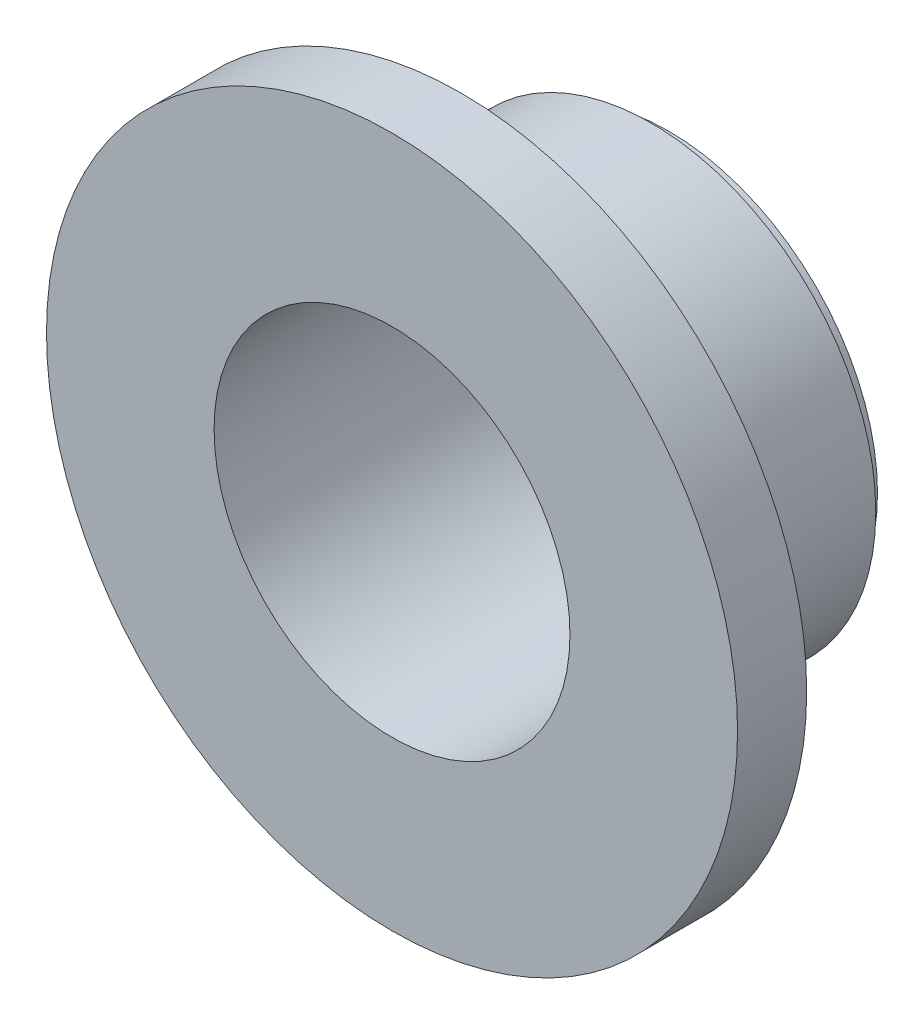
ISO-10303-21;
HEADER;
FILE_DESCRIPTION(('STEP AP214'),'2;1');
FILE_NAME('part.step','',(''),(''),'','','');
FILE_SCHEMA(('AUTOMOTIVE_DESIGN { 1 0 10303 214 1 1 1 1 }'));
ENDSEC;
DATA;
#1=APPLICATION_CONTEXT('core data for automotive mechanical design processes');
#2=APPLICATION_PROTOCOL_DEFINITION('international standard','automotive_design',2000,#1);
#3=PRODUCT_CONTEXT('',#1,'mechanical');
#4=PRODUCT('Part','Part','',(#3));
#5=PRODUCT_RELATED_PRODUCT_CATEGORY('part','',(#4));
#6=PRODUCT_DEFINITION_FORMATION('','',#4);
#7=PRODUCT_DEFINITION_CONTEXT('part definition',#1,'design');
#8=PRODUCT_DEFINITION('design','',#6,#7);
#9=PRODUCT_DEFINITION_SHAPE('','',#8);
#10=(LENGTH_UNIT() NAMED_UNIT(*) SI_UNIT(.MILLI.,.METRE.));
#11=(NAMED_UNIT(*) PLANE_ANGLE_UNIT() SI_UNIT($,.RADIAN.));
#12=(NAMED_UNIT(*) SI_UNIT($,.STERADIAN.) SOLID_ANGLE_UNIT());
#13=UNCERTAINTY_MEASURE_WITH_UNIT(LENGTH_MEASURE(1.E-05),#10,'distance_accuracy_value','');
#14=(GEOMETRIC_REPRESENTATION_CONTEXT(3) GLOBAL_UNCERTAINTY_ASSIGNED_CONTEXT((#13)) GLOBAL_UNIT_ASSIGNED_CONTEXT((#10,
#11,#12)) REPRESENTATION_CONTEXT('',''));
#15=CARTESIAN_POINT('',(0.,0.,0.));
#16=DIRECTION('',(0.,0.,1.));
#17=DIRECTION('',(1.,0.,0.));
#18=AXIS2_PLACEMENT_3D('',#15,#16,#17);
#19=CARTESIAN_POINT('',(-30.6252380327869,42.4041757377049,5.));
#20=DIRECTION('',(0.,0.,1.));
#21=DIRECTION('',(1.,0.,0.));
#22=AXIS2_PLACEMENT_3D('',#19,#20,#21);
#23=CYLINDRICAL_SURFACE('',#22,7.5);
#24=CARTESIAN_POINT('',(-30.6252380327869,42.4041757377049,5.));
#25=DIRECTION('',(0.,0.,1.));
#26=DIRECTION('',(1.,0.,0.));
#27=AXIS2_PLACEMENT_3D('',#24,#25,#26);
#28=CIRCLE('',#27,7.5);
#29=CARTESIAN_POINT('',(-23.1252380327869,42.4041757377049,5.));
#30=VERTEX_POINT('',#29);
#31=EDGE_CURVE('E58',#30,#30,#28,.T.);
#32=ORIENTED_EDGE('',*,*,#31,.T.);
#33=EDGE_LOOP('',(#32));
#34=FACE_BOUND('',#33,.T.);
#35=CARTESIAN_POINT('',(-30.6252380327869,42.4041757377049,6.));
#36=DIRECTION('',(0.,0.,1.));
#37=DIRECTION('',(1.,0.,0.));
#38=AXIS2_PLACEMENT_3D('',#35,#36,#37);
#39=CIRCLE('',#38,7.5);
#40=CARTESIAN_POINT('',(-23.1252380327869,42.4041757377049,6.));
#41=VERTEX_POINT('',#40);
#42=EDGE_CURVE('E68',#41,#41,#39,.T.);
#43=ORIENTED_EDGE('',*,*,#42,.F.);
#44=EDGE_LOOP('',(#43));
#45=FACE_BOUND('',#44,.T.);
#46=ADVANCED_FACE('F35',(#34,#45),#23,.T.);
#47=CARTESIAN_POINT('',(-30.6252380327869,42.4041757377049,0.5));
#48=DIRECTION('',(0.,0.,1.));
#49=DIRECTION('',(1.,0.,0.));
#50=AXIS2_PLACEMENT_3D('',#47,#48,#49);
#51=CYLINDRICAL_SURFACE('',#50,6.5);
#52=CARTESIAN_POINT('',(-30.6252380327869,42.4041757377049,0.5));
#53=DIRECTION('',(0.,0.,1.));
#54=DIRECTION('',(1.,0.,0.));
#55=AXIS2_PLACEMENT_3D('',#52,#53,#54);
#56=CIRCLE('',#55,6.5);
#57=CARTESIAN_POINT('',(-24.1252380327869,42.4041757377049,0.5));
#58=VERTEX_POINT('',#57);
#59=EDGE_CURVE('E54',#58,#58,#56,.T.);
#60=ORIENTED_EDGE('',*,*,#59,.T.);
#61=EDGE_LOOP('',(#60));
#62=FACE_BOUND('',#61,.T.);
#63=CARTESIAN_POINT('',(-30.6252380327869,42.4041757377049,5.));
#64=DIRECTION('',(0.,0.,1.));
#65=DIRECTION('',(1.,0.,0.));
#66=AXIS2_PLACEMENT_3D('',#63,#64,#65);
#67=CIRCLE('',#66,6.5);
#68=CARTESIAN_POINT('',(-24.1252380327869,42.4041757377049,5.));
#69=VERTEX_POINT('',#68);
#70=EDGE_CURVE('E61',#69,#69,#67,.T.);
#71=ORIENTED_EDGE('',*,*,#70,.F.);
#72=EDGE_LOOP('',(#71));
#73=FACE_BOUND('',#72,.T.);
#74=ADVANCED_FACE('F78',(#62,#73),#51,.T.);
#75=CARTESIAN_POINT('',(-30.6252380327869,42.4041757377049,8.));
#76=DIRECTION('',(0.,0.,-1.));
#77=DIRECTION('',(-1.,0.,0.));
#78=AXIS2_PLACEMENT_3D('',#75,#76,#77);
#79=CYLINDRICAL_SURFACE('',#78,6.05);
#80=CARTESIAN_POINT('',(-30.6252380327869,42.4041757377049,0.));
#81=DIRECTION('',(0.,0.,1.));
#82=DIRECTION('',(1.,0.,0.));
#83=AXIS2_PLACEMENT_3D('',#80,#81,#82);
#84=CIRCLE('',#83,6.05);
#85=CARTESIAN_POINT('',(-24.5752380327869,42.4041757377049,0.));
#86=VERTEX_POINT('',#85);
#87=EDGE_CURVE('E42',#86,#86,#84,.T.);
#88=ORIENTED_EDGE('',*,*,#87,.T.);
#89=EDGE_LOOP('',(#88));
#90=FACE_BOUND('',#89,.T.);
#91=CARTESIAN_POINT('',(-30.6252380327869,42.4041757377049,0.5));
#92=DIRECTION('',(0.,0.,1.));
#93=DIRECTION('',(1.,0.,0.));
#94=AXIS2_PLACEMENT_3D('',#91,#92,#93);
#95=CIRCLE('',#94,6.05);
#96=CARTESIAN_POINT('',(-24.5752380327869,42.4041757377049,0.5));
#97=VERTEX_POINT('',#96);
#98=EDGE_CURVE('E10',#97,#97,#95,.T.);
#99=ORIENTED_EDGE('',*,*,#98,.F.);
#100=EDGE_LOOP('',(#99));
#101=FACE_BOUND('',#100,.T.);
#102=ADVANCED_FACE('F37',(#90,#101),#79,.T.);
#103=CARTESIAN_POINT('',(-30.6252380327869,42.4041757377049,8.));
#104=DIRECTION('',(0.,0.,1.));
#105=DIRECTION('',(1.,0.,0.));
#106=AXIS2_PLACEMENT_3D('',#103,#104,#105);
#107=PLANE('',#106);
#108=CARTESIAN_POINT('',(-30.6252380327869,42.4041757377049,8.));
#109=DIRECTION('',(0.,0.,1.));
#110=DIRECTION('',(1.,0.,0.));
#111=AXIS2_PLACEMENT_3D('',#108,#109,#110);
#112=CIRCLE('',#111,5.15);
#113=CARTESIAN_POINT('',(-25.4752380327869,42.4041757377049,8.));
#114=VERTEX_POINT('',#113);
#115=EDGE_CURVE('E46',#114,#114,#112,.T.);
#116=ORIENTED_EDGE('',*,*,#115,.F.);
#117=EDGE_LOOP('',(#116));
#118=FACE_BOUND('',#117,.T.);
#119=CARTESIAN_POINT('',(-30.6252380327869,42.4041757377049,8.));
#120=DIRECTION('',(0.,0.,1.));
#121=DIRECTION('',(1.,0.,0.));
#122=AXIS2_PLACEMENT_3D('',#119,#120,#121);
#123=CIRCLE('',#122,10.);
#124=CARTESIAN_POINT('',(-20.6252380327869,42.4041757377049,8.));
#125=VERTEX_POINT('',#124);
#126=EDGE_CURVE('E65',#125,#125,#123,.T.);
#127=ORIENTED_EDGE('',*,*,#126,.T.);
#128=EDGE_LOOP('',(#127));
#129=FACE_BOUND('',#128,.T.);
#130=ADVANCED_FACE('F98',(#118,#129),#107,.T.);
#131=CARTESIAN_POINT('',(-30.6252380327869,42.4041757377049,0.));
#132=DIRECTION('',(0.,0.,1.));
#133=DIRECTION('',(1.,0.,0.));
#134=AXIS2_PLACEMENT_3D('',#131,#132,#133);
#135=PLANE('',#134);
#136=ORIENTED_EDGE('',*,*,#87,.F.);
#137=EDGE_LOOP('',(#136));
#138=FACE_BOUND('',#137,.T.);
#139=CARTESIAN_POINT('',(-30.6252380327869,42.4041757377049,0.));
#140=DIRECTION('',(0.,0.,1.));
#141=DIRECTION('',(1.,0.,0.));
#142=AXIS2_PLACEMENT_3D('',#139,#140,#141);
#143=CIRCLE('',#142,5.15);
#144=CARTESIAN_POINT('',(-25.4752380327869,42.4041757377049,0.));
#145=VERTEX_POINT('',#144);
#146=EDGE_CURVE('E50',#145,#145,#143,.T.);
#147=ORIENTED_EDGE('',*,*,#146,.T.);
#148=EDGE_LOOP('',(#147));
#149=FACE_BOUND('',#148,.T.);
#150=ADVANCED_FACE('F96',(#138,#149),#135,.F.);
#151=CARTESIAN_POINT('',(-30.6252380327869,42.4041757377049,8.));
#152=DIRECTION('',(0.,0.,-1.));
#153=DIRECTION('',(-1.,0.,0.));
#154=AXIS2_PLACEMENT_3D('',#151,#152,#153);
#155=CYLINDRICAL_SURFACE('',#154,5.15);
#156=ORIENTED_EDGE('',*,*,#115,.T.);
#157=EDGE_LOOP('',(#156));
#158=FACE_BOUND('',#157,.T.);
#159=ORIENTED_EDGE('',*,*,#146,.F.);
#160=EDGE_LOOP('',(#159));
#161=FACE_BOUND('',#160,.T.);
#162=ADVANCED_FACE('F92',(#158,#161),#155,.F.);
#163=CARTESIAN_POINT('',(0.,0.,0.5));
#164=DIRECTION('',(0.,0.,1.));
#165=DIRECTION('',(1.,0.,0.));
#166=AXIS2_PLACEMENT_3D('',#163,#164,#165);
#167=PLANE('',#166);
#168=ORIENTED_EDGE('',*,*,#98,.T.);
#169=EDGE_LOOP('',(#168));
#170=FACE_BOUND('',#169,.T.);
#171=ORIENTED_EDGE('',*,*,#59,.F.);
#172=EDGE_LOOP('',(#171));
#173=FACE_BOUND('',#172,.T.);
#174=ADVANCED_FACE('F90',(#170,#173),#167,.F.);
#175=CARTESIAN_POINT('',(0.,0.,5.));
#176=DIRECTION('',(0.,0.,1.));
#177=DIRECTION('',(1.,0.,0.));
#178=AXIS2_PLACEMENT_3D('',#175,#176,#177);
#179=PLANE('',#178);
#180=ORIENTED_EDGE('',*,*,#70,.T.);
#181=EDGE_LOOP('',(#180));
#182=FACE_BOUND('',#181,.T.);
#183=ORIENTED_EDGE('',*,*,#31,.F.);
#184=EDGE_LOOP('',(#183));
#185=FACE_BOUND('',#184,.T.);
#186=ADVANCED_FACE('F88',(#182,#185),#179,.F.);
#187=CARTESIAN_POINT('',(-30.6252380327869,42.4041757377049,6.));
#188=DIRECTION('',(0.,0.,1.));
#189=DIRECTION('',(1.,0.,0.));
#190=AXIS2_PLACEMENT_3D('',#187,#188,#189);
#191=CYLINDRICAL_SURFACE('',#190,10.);
#192=CARTESIAN_POINT('',(-30.6252380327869,42.4041757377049,6.));
#193=DIRECTION('',(0.,0.,1.));
#194=DIRECTION('',(1.,0.,0.));
#195=AXIS2_PLACEMENT_3D('',#192,#193,#194);
#196=CIRCLE('',#195,10.);
#197=CARTESIAN_POINT('',(-20.6252380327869,42.4041757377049,6.));
#198=VERTEX_POINT('',#197);
#199=EDGE_CURVE('E64',#198,#198,#196,.T.);
#200=ORIENTED_EDGE('',*,*,#199,.T.);
#201=EDGE_LOOP('',(#200));
#202=FACE_BOUND('',#201,.T.);
#203=ORIENTED_EDGE('',*,*,#126,.F.);
#204=EDGE_LOOP('',(#203));
#205=FACE_BOUND('',#204,.T.);
#206=ADVANCED_FACE('F127',(#202,#205),#191,.T.);
#207=CARTESIAN_POINT('',(0.,0.,6.));
#208=DIRECTION('',(0.,0.,1.));
#209=DIRECTION('',(1.,0.,0.));
#210=AXIS2_PLACEMENT_3D('',#207,#208,#209);
#211=PLANE('',#210);
#212=ORIENTED_EDGE('',*,*,#42,.T.);
#213=EDGE_LOOP('',(#212));
#214=FACE_BOUND('',#213,.T.);
#215=ORIENTED_EDGE('',*,*,#199,.F.);
#216=EDGE_LOOP('',(#215));
#217=FACE_BOUND('',#216,.T.);
#218=ADVANCED_FACE('F74',(#214,#217),#211,.F.);
#219=CLOSED_SHELL('',(#46,#74,#102,#130,#150,#162,#174,#186,#206,#218));
#220=MANIFOLD_SOLID_BREP('B2',#219);
#221=ADVANCED_BREP_SHAPE_REPRESENTATION('',(#18,#220),#14);
#222=SHAPE_DEFINITION_REPRESENTATION(#9,#221);
ENDSEC;
END-ISO-10303-21;
